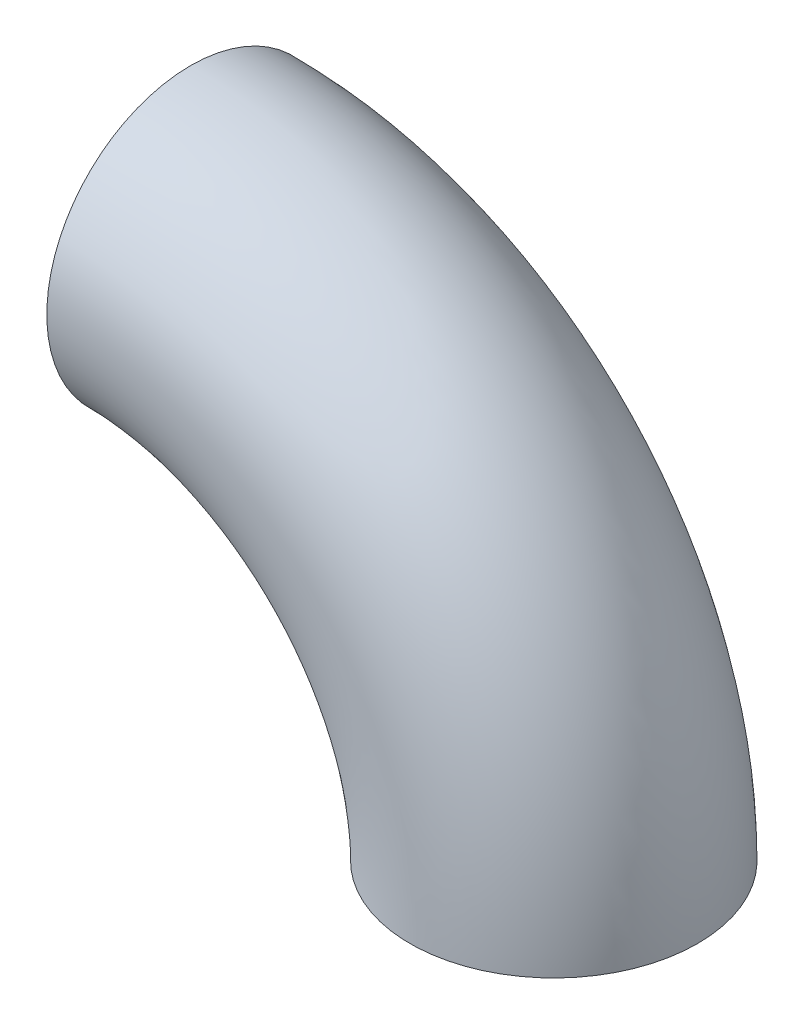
from build123d import *

# Parameters (mm, degrees)
SKETCH1_R   = 30.1625
SKETCH1_R_2 = 26.2509


with BuildPart() as part:
    # Sweep1: sweep along a path in Sketch2
    with BuildLine(Plane.XY) as sweep1_path:
        ThreePointArc((0, 0), (-22.318463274, 53.881536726), (-76.2, 76.2))
    # Sketch1 → Sweep1 (sweep)
    with BuildSketch(Plane(origin=(0, 0, 0), x_dir=(1, 0, 0), z_dir=(0, 1, 0))):
        Circle(SKETCH1_R)
        Circle(SKETCH1_R_2, mode=Mode.SUBTRACT)
    sweep(path=sweep1_path.line)


solid = part.part
